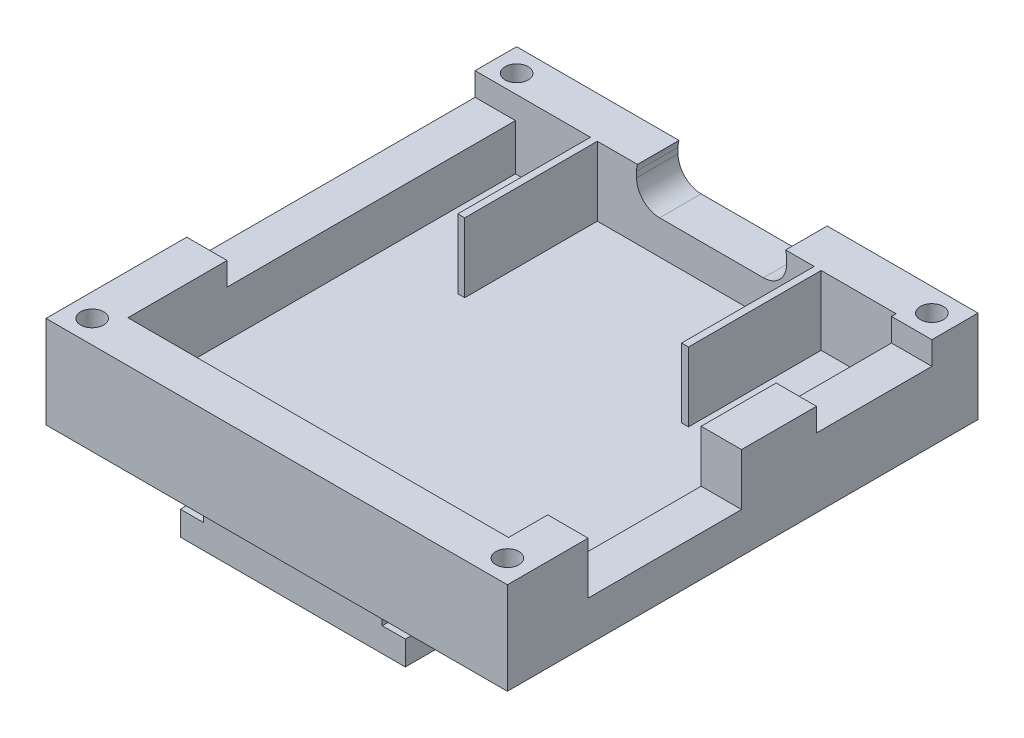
ISO-10303-21;
HEADER;
FILE_DESCRIPTION(('STEP AP214'),'2;1');
FILE_NAME('part.step','',(''),(''),'','','');
FILE_SCHEMA(('AUTOMOTIVE_DESIGN { 1 0 10303 214 1 1 1 1 }'));
ENDSEC;
DATA;
#1=APPLICATION_CONTEXT('core data for automotive mechanical design processes');
#2=APPLICATION_PROTOCOL_DEFINITION('international standard','automotive_design',2000,#1);
#3=PRODUCT_CONTEXT('',#1,'mechanical');
#4=PRODUCT('Part','Part','',(#3));
#5=PRODUCT_RELATED_PRODUCT_CATEGORY('part','',(#4));
#6=PRODUCT_DEFINITION_FORMATION('','',#4);
#7=PRODUCT_DEFINITION_CONTEXT('part definition',#1,'design');
#8=PRODUCT_DEFINITION('design','',#6,#7);
#9=PRODUCT_DEFINITION_SHAPE('','',#8);
#10=(LENGTH_UNIT() NAMED_UNIT(*) SI_UNIT(.MILLI.,.METRE.));
#11=(NAMED_UNIT(*) PLANE_ANGLE_UNIT() SI_UNIT($,.RADIAN.));
#12=(NAMED_UNIT(*) SI_UNIT($,.STERADIAN.) SOLID_ANGLE_UNIT());
#13=UNCERTAINTY_MEASURE_WITH_UNIT(LENGTH_MEASURE(1.E-05),#10,'distance_accuracy_value','');
#14=(GEOMETRIC_REPRESENTATION_CONTEXT(3) GLOBAL_UNCERTAINTY_ASSIGNED_CONTEXT((#13)) GLOBAL_UNIT_ASSIGNED_CONTEXT((#10,
#11,#12)) REPRESENTATION_CONTEXT('',''));
#15=CARTESIAN_POINT('',(0.,0.,0.));
#16=DIRECTION('',(0.,0.,1.));
#17=DIRECTION('',(1.,0.,0.));
#18=AXIS2_PLACEMENT_3D('',#15,#16,#17);
#19=CARTESIAN_POINT('',(-16.5,6.00000000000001,2.2));
#20=DIRECTION('',(0.,0.,-1.));
#21=DIRECTION('',(-1.,0.,0.));
#22=AXIS2_PLACEMENT_3D('',#19,#20,#21);
#23=PLANE('',#22);
#24=DIRECTION('',(0.,-1.,0.));
#25=VECTOR('',#24,1.);
#26=CARTESIAN_POINT('',(9.4,12.,2.19999999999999));
#27=LINE('',#26,#25);
#28=CARTESIAN_POINT('',(9.4,12.,2.2));
#29=VERTEX_POINT('',#28);
#30=CARTESIAN_POINT('',(9.4,6.00000000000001,2.2));
#31=VERTEX_POINT('',#30);
#32=EDGE_CURVE('E347',#29,#31,#27,.T.);
#33=ORIENTED_EDGE('',*,*,#32,.F.);
#34=DIRECTION('',(-1.,0.,0.));
#35=VECTOR('',#34,1.);
#36=CARTESIAN_POINT('',(-16.5,12.,2.2));
#37=LINE('',#36,#35);
#38=CARTESIAN_POINT('',(6.92288845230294,12.,2.2));
#39=VERTEX_POINT('',#38);
#40=EDGE_CURVE('E333',#29,#39,#37,.T.);
#41=ORIENTED_EDGE('',*,*,#40,.T.);
#42=CARTESIAN_POINT('',(5.,11.45,2.2));
#43=DIRECTION('',(0.,0.,-1.));
#44=DIRECTION('',(-1.,0.,0.));
#45=AXIS2_PLACEMENT_3D('',#42,#43,#44);
#46=CIRCLE('',#45,2.);
#47=CARTESIAN_POINT('',(7.,11.45,2.2));
#48=VERTEX_POINT('',#47);
#49=EDGE_CURVE('E11',#39,#48,#46,.T.);
#50=ORIENTED_EDGE('',*,*,#49,.T.);
#51=DIRECTION('',(0.,-1.,0.));
#52=VECTOR('',#51,1.);
#53=CARTESIAN_POINT('',(7.00000000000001,6.00000000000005,2.2));
#54=LINE('',#53,#52);
#55=CARTESIAN_POINT('',(7.,10.95,2.2));
#56=VERTEX_POINT('',#55);
#57=EDGE_CURVE('E54',#48,#56,#54,.T.);
#58=ORIENTED_EDGE('',*,*,#57,.T.);
#59=CARTESIAN_POINT('',(5.,10.95,2.2));
#60=DIRECTION('',(0.,0.,-1.));
#61=DIRECTION('',(-1.,0.,0.));
#62=AXIS2_PLACEMENT_3D('',#59,#60,#61);
#63=CIRCLE('',#62,2.);
#64=CARTESIAN_POINT('',(5.,8.95000000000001,2.2));
#65=VERTEX_POINT('',#64);
#66=EDGE_CURVE('E795',#56,#65,#63,.T.);
#67=ORIENTED_EDGE('',*,*,#66,.T.);
#68=DIRECTION('',(-1.,0.,0.));
#69=VECTOR('',#68,1.);
#70=CARTESIAN_POINT('',(-16.5,8.95000000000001,2.2));
#71=LINE('',#70,#69);
#72=CARTESIAN_POINT('',(-4.,8.95000000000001,2.2));
#73=VERTEX_POINT('',#72);
#74=EDGE_CURVE('E780',#65,#73,#71,.T.);
#75=ORIENTED_EDGE('',*,*,#74,.T.);
#76=CARTESIAN_POINT('',(-4.,10.95,2.2));
#77=DIRECTION('',(0.,0.,-1.));
#78=DIRECTION('',(-1.,0.,0.));
#79=AXIS2_PLACEMENT_3D('',#76,#77,#78);
#80=CIRCLE('',#79,2.);
#81=CARTESIAN_POINT('',(-6.,10.95,2.2));
#82=VERTEX_POINT('',#81);
#83=EDGE_CURVE('E784',#73,#82,#80,.T.);
#84=ORIENTED_EDGE('',*,*,#83,.T.);
#85=DIRECTION('',(0.,1.,0.));
#86=VECTOR('',#85,1.);
#87=CARTESIAN_POINT('',(-6.,6.00000000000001,2.2));
#88=LINE('',#87,#86);
#89=CARTESIAN_POINT('',(-6.,11.45,2.2));
#90=VERTEX_POINT('',#89);
#91=EDGE_CURVE('E788',#82,#90,#88,.T.);
#92=ORIENTED_EDGE('',*,*,#91,.T.);
#93=CARTESIAN_POINT('',(-4.,11.45,2.2));
#94=DIRECTION('',(0.,0.,-1.));
#95=DIRECTION('',(-1.,0.,0.));
#96=AXIS2_PLACEMENT_3D('',#93,#94,#95);
#97=CIRCLE('',#96,2.);
#98=CARTESIAN_POINT('',(-5.92288845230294,12.,2.2));
#99=VERTEX_POINT('',#98);
#100=EDGE_CURVE('E792',#90,#99,#97,.T.);
#101=ORIENTED_EDGE('',*,*,#100,.T.);
#102=CARTESIAN_POINT('',(-9.4,12.,2.2));
#103=VERTEX_POINT('',#102);
#104=EDGE_CURVE('E69',#99,#103,#37,.T.);
#105=ORIENTED_EDGE('',*,*,#104,.T.);
#106=DIRECTION('',(0.,-1.,0.));
#107=VECTOR('',#106,1.);
#108=CARTESIAN_POINT('',(-9.4,12.,2.19999999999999));
#109=LINE('',#108,#107);
#110=CARTESIAN_POINT('',(-9.4,6.00000000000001,2.19999999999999));
#111=VERTEX_POINT('',#110);
#112=EDGE_CURVE('E385',#103,#111,#109,.T.);
#113=ORIENTED_EDGE('',*,*,#112,.T.);
#114=DIRECTION('',(-1.,0.,0.));
#115=VECTOR('',#114,1.);
#116=CARTESIAN_POINT('',(-16.5,6.00000000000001,2.2));
#117=LINE('',#116,#115);
#118=EDGE_CURVE('E580',#31,#111,#117,.T.);
#119=ORIENTED_EDGE('',*,*,#118,.F.);
#120=EDGE_LOOP('',(#33,#41,#50,#58,#67,#75,#84,#92,#101,#105,#113,#119));
#121=FACE_BOUND('',#120,.T.);
#122=ADVANCED_FACE('F45',(#121),#23,.F.);
#123=DIRECTION('',(0.,-1.,0.));
#124=VECTOR('',#123,1.);
#125=CARTESIAN_POINT('',(10.,12.,2.19999999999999));
#126=LINE('',#125,#124);
#127=CARTESIAN_POINT('',(9.99999999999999,12.,2.2));
#128=VERTEX_POINT('',#127);
#129=CARTESIAN_POINT('',(10.,6.00000000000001,2.19999999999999));
#130=VERTEX_POINT('',#129);
#131=EDGE_CURVE('E357',#128,#130,#126,.T.);
#132=ORIENTED_EDGE('',*,*,#131,.T.);
#133=CARTESIAN_POINT('',(16.5,6.00000000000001,2.2));
#134=VERTEX_POINT('',#133);
#135=EDGE_CURVE('E576',#134,#130,#117,.T.);
#136=ORIENTED_EDGE('',*,*,#135,.F.);
#137=DIRECTION('',(0.,1.,0.));
#138=VECTOR('',#137,1.);
#139=CARTESIAN_POINT('',(16.5,6.00000000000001,2.2));
#140=LINE('',#139,#138);
#141=CARTESIAN_POINT('',(16.5,12.,2.19999999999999));
#142=VERTEX_POINT('',#141);
#143=EDGE_CURVE('E588',#134,#142,#140,.T.);
#144=ORIENTED_EDGE('',*,*,#143,.T.);
#145=EDGE_CURVE('E595',#142,#128,#37,.T.);
#146=ORIENTED_EDGE('',*,*,#145,.T.);
#147=EDGE_LOOP('',(#132,#136,#144,#146));
#148=FACE_BOUND('',#147,.T.);
#149=ADVANCED_FACE('F873',(#148),#23,.F.);
#150=DIRECTION('',(0.,-1.,0.));
#151=VECTOR('',#150,1.);
#152=CARTESIAN_POINT('',(-10.,12.,2.19999999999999));
#153=LINE('',#152,#151);
#154=CARTESIAN_POINT('',(-10.,12.,2.2));
#155=VERTEX_POINT('',#154);
#156=CARTESIAN_POINT('',(-10.,6.00000000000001,2.2));
#157=VERTEX_POINT('',#156);
#158=EDGE_CURVE('E61',#155,#157,#153,.T.);
#159=ORIENTED_EDGE('',*,*,#158,.F.);
#160=CARTESIAN_POINT('',(-20.,12.,2.2));
#161=VERTEX_POINT('',#160);
#162=EDGE_CURVE('E593',#155,#161,#37,.T.);
#163=ORIENTED_EDGE('',*,*,#162,.T.);
#164=DIRECTION('',(0.,-1.,0.));
#165=VECTOR('',#164,1.);
#166=CARTESIAN_POINT('',(-20.,10.,2.2));
#167=LINE('',#166,#165);
#168=CARTESIAN_POINT('',(-20.,10.,2.2));
#169=VERTEX_POINT('',#168);
#170=EDGE_CURVE('E547',#161,#169,#167,.T.);
#171=ORIENTED_EDGE('',*,*,#170,.T.);
#172=DIRECTION('',(-1.,0.,0.));
#173=VECTOR('',#172,1.);
#174=CARTESIAN_POINT('',(-7.99999999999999,10.,2.2));
#175=LINE('',#174,#173);
#176=CARTESIAN_POINT('',(-16.5,10.,2.2));
#177=VERTEX_POINT('',#176);
#178=EDGE_CURVE('E554',#177,#169,#175,.T.);
#179=ORIENTED_EDGE('',*,*,#178,.F.);
#180=DIRECTION('',(0.,1.,0.));
#181=VECTOR('',#180,1.);
#182=CARTESIAN_POINT('',(-16.5,6.00000000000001,2.2));
#183=LINE('',#182,#181);
#184=CARTESIAN_POINT('',(-16.5,6.00000000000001,2.2));
#185=VERTEX_POINT('',#184);
#186=EDGE_CURVE('E612',#185,#177,#183,.T.);
#187=ORIENTED_EDGE('',*,*,#186,.F.);
#188=EDGE_CURVE('E574',#157,#185,#117,.T.);
#189=ORIENTED_EDGE('',*,*,#188,.F.);
#190=EDGE_LOOP('',(#159,#163,#171,#179,#187,#189));
#191=FACE_BOUND('',#190,.T.);
#192=ADVANCED_FACE('F839',(#191),#23,.F.);
#193=CARTESIAN_POINT('',(0.,6.00000000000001,0.));
#194=DIRECTION('',(0.,-1.,0.));
#195=DIRECTION('',(0.,0.,-1.));
#196=AXIS2_PLACEMENT_3D('',#193,#194,#195);
#197=PLANE('',#196);
#198=DIRECTION('',(0.,0.,1.));
#199=VECTOR('',#198,1.);
#200=CARTESIAN_POINT('',(9.4,6.00000000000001,13.7));
#201=LINE('',#200,#199);
#202=CARTESIAN_POINT('',(9.4,6.00000000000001,13.7));
#203=VERTEX_POINT('',#202);
#204=EDGE_CURVE('E343',#31,#203,#201,.T.);
#205=ORIENTED_EDGE('',*,*,#204,.F.);
#206=ORIENTED_EDGE('',*,*,#118,.T.);
#207=DIRECTION('',(0.,0.,-1.));
#208=VECTOR('',#207,1.);
#209=CARTESIAN_POINT('',(-9.4,6.00000000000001,13.7));
#210=LINE('',#209,#208);
#211=CARTESIAN_POINT('',(-9.4,6.00000000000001,13.7));
#212=VERTEX_POINT('',#211);
#213=EDGE_CURVE('E391',#212,#111,#210,.T.);
#214=ORIENTED_EDGE('',*,*,#213,.F.);
#215=DIRECTION('',(1.,0.,0.));
#216=VECTOR('',#215,1.);
#217=CARTESIAN_POINT('',(-10.,6.00000000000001,13.7));
#218=LINE('',#217,#216);
#219=CARTESIAN_POINT('',(-10.,6.00000000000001,13.7));
#220=VERTEX_POINT('',#219);
#221=EDGE_CURVE('E395',#220,#212,#218,.T.);
#222=ORIENTED_EDGE('',*,*,#221,.F.);
#223=DIRECTION('',(0.,0.,1.));
#224=VECTOR('',#223,1.);
#225=CARTESIAN_POINT('',(-10.,6.00000000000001,13.7));
#226=LINE('',#225,#224);
#227=EDGE_CURVE('E363',#157,#220,#226,.T.);
#228=ORIENTED_EDGE('',*,*,#227,.F.);
#229=ORIENTED_EDGE('',*,*,#188,.T.);
#230=DIRECTION('',(0.,0.,1.));
#231=VECTOR('',#230,1.);
#232=CARTESIAN_POINT('',(-16.5,6.00000000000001,35.8));
#233=LINE('',#232,#231);
#234=CARTESIAN_POINT('',(-16.5,6.00000000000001,35.8));
#235=VERTEX_POINT('',#234);
#236=EDGE_CURVE('E579',#185,#235,#233,.T.);
#237=ORIENTED_EDGE('',*,*,#236,.T.);
#238=DIRECTION('',(1.,0.,0.));
#239=VECTOR('',#238,1.);
#240=CARTESIAN_POINT('',(-16.5,6.00000000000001,35.8));
#241=LINE('',#240,#239);
#242=CARTESIAN_POINT('',(16.5,6.00000000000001,35.8));
#243=VERTEX_POINT('',#242);
#244=EDGE_CURVE('E584',#235,#243,#241,.T.);
#245=ORIENTED_EDGE('',*,*,#244,.T.);
#246=DIRECTION('',(0.,0.,-1.));
#247=VECTOR('',#246,1.);
#248=CARTESIAN_POINT('',(16.5,6.00000000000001,35.8));
#249=LINE('',#248,#247);
#250=EDGE_CURVE('E570',#243,#134,#249,.T.);
#251=ORIENTED_EDGE('',*,*,#250,.T.);
#252=ORIENTED_EDGE('',*,*,#135,.T.);
#253=DIRECTION('',(0.,0.,-1.));
#254=VECTOR('',#253,1.);
#255=CARTESIAN_POINT('',(10.,6.00000000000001,13.7));
#256=LINE('',#255,#254);
#257=CARTESIAN_POINT('',(10.,6.00000000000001,13.7));
#258=VERTEX_POINT('',#257);
#259=EDGE_CURVE('E337',#258,#130,#256,.T.);
#260=ORIENTED_EDGE('',*,*,#259,.F.);
#261=DIRECTION('',(1.,0.,0.));
#262=VECTOR('',#261,1.);
#263=CARTESIAN_POINT('',(9.4,6.00000000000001,13.7));
#264=LINE('',#263,#262);
#265=EDGE_CURVE('E362',#203,#258,#264,.T.);
#266=ORIENTED_EDGE('',*,*,#265,.F.);
#267=EDGE_LOOP('',(#205,#206,#214,#222,#228,#229,#237,#245,#251,#252,#260,#266));
#268=FACE_BOUND('',#267,.T.);
#269=ADVANCED_FACE('F854',(#268),#197,.F.);
#270=CARTESIAN_POINT('',(-20.,12.,38.));
#271=DIRECTION('',(0.,-1.,0.));
#272=DIRECTION('',(1.,0.,0.));
#273=AXIS2_PLACEMENT_3D('',#270,#271,#272);
#274=PLANE('',#273);
#275=CARTESIAN_POINT('',(18.,12.,0.599999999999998));
#276=DIRECTION('',(0.,1.,0.));
#277=DIRECTION('',(0.,0.,1.));
#278=AXIS2_PLACEMENT_3D('',#275,#276,#277);
#279=CIRCLE('',#278,1.);
#280=CARTESIAN_POINT('',(18.,12.,1.6));
#281=VERTEX_POINT('',#280);
#282=EDGE_CURVE('E411',#281,#281,#279,.T.);
#283=ORIENTED_EDGE('',*,*,#282,.F.);
#284=EDGE_LOOP('',(#283));
#285=FACE_BOUND('',#284,.T.);
#286=DIRECTION('',(1.,0.,0.));
#287=VECTOR('',#286,1.);
#288=CARTESIAN_POINT('',(20.,12.,-1.4));
#289=LINE('',#288,#287);
#290=CARTESIAN_POINT('',(6.92288845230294,12.,-1.4));
#291=VERTEX_POINT('',#290);
#292=CARTESIAN_POINT('',(20.,12.,-1.4));
#293=VERTEX_POINT('',#292);
#294=EDGE_CURVE('E622',#291,#293,#289,.T.);
#295=ORIENTED_EDGE('',*,*,#294,.F.);
#296=DIRECTION('',(0.,0.,-1.));
#297=VECTOR('',#296,1.);
#298=CARTESIAN_POINT('',(6.92288845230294,12.,5.6));
#299=LINE('',#298,#297);
#300=EDGE_CURVE('E491',#291,#39,#299,.F.);
#301=ORIENTED_EDGE('',*,*,#300,.T.);
#302=ORIENTED_EDGE('',*,*,#40,.F.);
#303=DIRECTION('',(0.,0.,1.));
#304=VECTOR('',#303,1.);
#305=CARTESIAN_POINT('',(9.4,12.,13.7));
#306=LINE('',#305,#304);
#307=CARTESIAN_POINT('',(9.4,12.,13.7));
#308=VERTEX_POINT('',#307);
#309=EDGE_CURVE('E324',#29,#308,#306,.T.);
#310=ORIENTED_EDGE('',*,*,#309,.T.);
#311=DIRECTION('',(1.,0.,0.));
#312=VECTOR('',#311,1.);
#313=CARTESIAN_POINT('',(9.4,12.,13.7));
#314=LINE('',#313,#312);
#315=CARTESIAN_POINT('',(10.,12.,13.7));
#316=VERTEX_POINT('',#315);
#317=EDGE_CURVE('E330',#308,#316,#314,.T.);
#318=ORIENTED_EDGE('',*,*,#317,.T.);
#319=DIRECTION('',(0.,0.,-1.));
#320=VECTOR('',#319,1.);
#321=CARTESIAN_POINT('',(10.,12.,13.7));
#322=LINE('',#321,#320);
#323=EDGE_CURVE('E354',#316,#128,#322,.T.);
#324=ORIENTED_EDGE('',*,*,#323,.T.);
#325=ORIENTED_EDGE('',*,*,#145,.F.);
#326=DIRECTION('',(0.,0.,-1.));
#327=VECTOR('',#326,1.);
#328=CARTESIAN_POINT('',(16.5,12.,35.8));
#329=LINE('',#328,#327);
#330=CARTESIAN_POINT('',(16.5,12.,2.6));
#331=VERTEX_POINT('',#330);
#332=EDGE_CURVE('E569',#331,#142,#329,.T.);
#333=ORIENTED_EDGE('',*,*,#332,.F.);
#334=DIRECTION('',(1.,0.,0.));
#335=VECTOR('',#334,1.);
#336=CARTESIAN_POINT('',(-20.,12.,2.6));
#337=LINE('',#336,#335);
#338=CARTESIAN_POINT('',(20.,12.,2.6));
#339=VERTEX_POINT('',#338);
#340=EDGE_CURVE('E540',#331,#339,#337,.T.);
#341=ORIENTED_EDGE('',*,*,#340,.T.);
#342=DIRECTION('',(0.,0.,-1.));
#343=VECTOR('',#342,1.);
#344=CARTESIAN_POINT('',(20.,12.,38.));
#345=LINE('',#344,#343);
#346=EDGE_CURVE('E733',#339,#293,#345,.T.);
#347=ORIENTED_EDGE('',*,*,#346,.T.);
#348=EDGE_LOOP('',(#295,#301,#302,#310,#318,#324,#325,#333,#341,#347));
#349=FACE_BOUND('',#348,.T.);
#350=ADVANCED_FACE('F327',(#285,#349),#274,.F.);
#351=CARTESIAN_POINT('',(-18.,12.,0.599999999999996));
#352=DIRECTION('',(0.,1.,0.));
#353=DIRECTION('',(0.,0.,1.));
#354=AXIS2_PLACEMENT_3D('',#351,#352,#353);
#355=CIRCLE('',#354,1.);
#356=CARTESIAN_POINT('',(-18.,12.,1.6));
#357=VERTEX_POINT('',#356);
#358=EDGE_CURVE('E428',#357,#357,#355,.T.);
#359=ORIENTED_EDGE('',*,*,#358,.F.);
#360=EDGE_LOOP('',(#359));
#361=FACE_BOUND('',#360,.T.);
#362=ORIENTED_EDGE('',*,*,#104,.F.);
#363=DIRECTION('',(0.,0.,-1.));
#364=VECTOR('',#363,1.);
#365=CARTESIAN_POINT('',(-5.92288845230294,12.,5.6));
#366=LINE('',#365,#364);
#367=CARTESIAN_POINT('',(-5.92288845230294,12.,-1.4));
#368=VERTEX_POINT('',#367);
#369=EDGE_CURVE('E473',#99,#368,#366,.T.);
#370=ORIENTED_EDGE('',*,*,#369,.T.);
#371=CARTESIAN_POINT('',(-20.,12.,-1.4));
#372=VERTEX_POINT('',#371);
#373=EDGE_CURVE('E623',#372,#368,#289,.T.);
#374=ORIENTED_EDGE('',*,*,#373,.F.);
#375=DIRECTION('',(0.,0.,-1.));
#376=VECTOR('',#375,1.);
#377=CARTESIAN_POINT('',(-20.,12.,38.));
#378=LINE('',#377,#376);
#379=EDGE_CURVE('E728',#161,#372,#378,.T.);
#380=ORIENTED_EDGE('',*,*,#379,.F.);
#381=ORIENTED_EDGE('',*,*,#162,.F.);
#382=DIRECTION('',(0.,0.,1.));
#383=VECTOR('',#382,1.);
#384=CARTESIAN_POINT('',(-10.,12.,13.7));
#385=LINE('',#384,#383);
#386=CARTESIAN_POINT('',(-10.,12.,13.7));
#387=VERTEX_POINT('',#386);
#388=EDGE_CURVE('E396',#155,#387,#385,.T.);
#389=ORIENTED_EDGE('',*,*,#388,.T.);
#390=DIRECTION('',(1.,0.,0.));
#391=VECTOR('',#390,1.);
#392=CARTESIAN_POINT('',(-10.,12.,13.7));
#393=LINE('',#392,#391);
#394=CARTESIAN_POINT('',(-9.4,12.,13.7));
#395=VERTEX_POINT('',#394);
#396=EDGE_CURVE('E405',#387,#395,#393,.T.);
#397=ORIENTED_EDGE('',*,*,#396,.T.);
#398=DIRECTION('',(0.,0.,-1.));
#399=VECTOR('',#398,1.);
#400=CARTESIAN_POINT('',(-9.4,12.,13.7));
#401=LINE('',#400,#399);
#402=EDGE_CURVE('E390',#395,#103,#401,.T.);
#403=ORIENTED_EDGE('',*,*,#402,.T.);
#404=EDGE_LOOP('',(#362,#370,#374,#380,#381,#389,#397,#403));
#405=FACE_BOUND('',#404,.T.);
#406=ADVANCED_FACE('F831',(#361,#405),#274,.F.);
#407=CARTESIAN_POINT('',(20.,12.,19.1));
#408=VERTEX_POINT('',#407);
#409=CARTESIAN_POINT('',(20.,12.,12.6));
#410=VERTEX_POINT('',#409);
#411=EDGE_CURVE('E739',#408,#410,#345,.T.);
#412=ORIENTED_EDGE('',*,*,#411,.T.);
#413=DIRECTION('',(-1.,0.,0.));
#414=VECTOR('',#413,1.);
#415=CARTESIAN_POINT('',(-20.,12.,12.6));
#416=LINE('',#415,#414);
#417=CARTESIAN_POINT('',(16.5,12.,12.6));
#418=VERTEX_POINT('',#417);
#419=EDGE_CURVE('E536',#410,#418,#416,.T.);
#420=ORIENTED_EDGE('',*,*,#419,.T.);
#421=CARTESIAN_POINT('',(16.5,12.,19.1));
#422=VERTEX_POINT('',#421);
#423=EDGE_CURVE('E594',#422,#418,#329,.T.);
#424=ORIENTED_EDGE('',*,*,#423,.F.);
#425=DIRECTION('',(1.,0.,0.));
#426=VECTOR('',#425,1.);
#427=CARTESIAN_POINT('',(-20.,12.,19.1));
#428=LINE('',#427,#426);
#429=EDGE_CURVE('E532',#422,#408,#428,.T.);
#430=ORIENTED_EDGE('',*,*,#429,.T.);
#431=EDGE_LOOP('',(#412,#420,#424,#430));
#432=FACE_BOUND('',#431,.T.);
#433=ADVANCED_FACE('F886',(#432),#274,.F.);
#434=CARTESIAN_POINT('',(0.,0.,0.));
#435=DIRECTION('',(0.,0.,1.));
#436=DIRECTION('',(1.,0.,0.));
#437=AXIS2_PLACEMENT_3D('',#434,#435,#436);
#438=PLANE('',#437);
#439=DIRECTION('',(-1.,0.,0.));
#440=VECTOR('',#439,1.);
#441=CARTESIAN_POINT('',(20.,4.00000000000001,0.));
#442=LINE('',#441,#440);
#443=CARTESIAN_POINT('',(7.75,4.00000000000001,0.));
#444=VERTEX_POINT('',#443);
#445=CARTESIAN_POINT('',(-7.75,4.00000000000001,0.));
#446=VERTEX_POINT('',#445);
#447=EDGE_CURVE('E636',#444,#446,#442,.T.);
#448=ORIENTED_EDGE('',*,*,#447,.F.);
#449=DIRECTION('',(0.,1.,0.));
#450=VECTOR('',#449,1.);
#451=CARTESIAN_POINT('',(7.75,4.00000000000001,0.));
#452=LINE('',#451,#450);
#453=CARTESIAN_POINT('',(7.75,2.10000000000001,0.));
#454=VERTEX_POINT('',#453);
#455=EDGE_CURVE('E691',#454,#444,#452,.T.);
#456=ORIENTED_EDGE('',*,*,#455,.F.);
#457=DIRECTION('',(-1.,0.,0.));
#458=VECTOR('',#457,1.);
#459=CARTESIAN_POINT('',(7.75,2.10000000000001,0.));
#460=LINE('',#459,#458);
#461=CARTESIAN_POINT('',(9.75,2.1,0.));
#462=VERTEX_POINT('',#461);
#463=EDGE_CURVE('E688',#462,#454,#460,.T.);
#464=ORIENTED_EDGE('',*,*,#463,.F.);
#465=DIRECTION('',(0.,1.,0.));
#466=VECTOR('',#465,1.);
#467=CARTESIAN_POINT('',(9.75,2.1,0.));
#468=LINE('',#467,#466);
#469=CARTESIAN_POINT('',(9.75,0.,0.));
#470=VERTEX_POINT('',#469);
#471=EDGE_CURVE('E656',#470,#462,#468,.T.);
#472=ORIENTED_EDGE('',*,*,#471,.F.);
#473=DIRECTION('',(1.,0.,0.));
#474=VECTOR('',#473,1.);
#475=CARTESIAN_POINT('',(-9.75,0.,0.));
#476=LINE('',#475,#474);
#477=CARTESIAN_POINT('',(-9.75,0.,0.));
#478=VERTEX_POINT('',#477);
#479=EDGE_CURVE('E666',#478,#470,#476,.T.);
#480=ORIENTED_EDGE('',*,*,#479,.F.);
#481=DIRECTION('',(0.,-1.,0.));
#482=VECTOR('',#481,1.);
#483=CARTESIAN_POINT('',(-9.75,2.1,0.));
#484=LINE('',#483,#482);
#485=CARTESIAN_POINT('',(-9.75,2.1,0.));
#486=VERTEX_POINT('',#485);
#487=EDGE_CURVE('E701',#486,#478,#484,.T.);
#488=ORIENTED_EDGE('',*,*,#487,.F.);
#489=DIRECTION('',(-1.,0.,0.));
#490=VECTOR('',#489,1.);
#491=CARTESIAN_POINT('',(-9.75,2.1,0.));
#492=LINE('',#491,#490);
#493=CARTESIAN_POINT('',(-7.75,2.10000000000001,0.));
#494=VERTEX_POINT('',#493);
#495=EDGE_CURVE('E698',#494,#486,#492,.T.);
#496=ORIENTED_EDGE('',*,*,#495,.F.);
#497=DIRECTION('',(0.,-1.,0.));
#498=VECTOR('',#497,1.);
#499=CARTESIAN_POINT('',(-7.75,4.00000000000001,0.));
#500=LINE('',#499,#498);
#501=EDGE_CURVE('E695',#446,#494,#500,.T.);
#502=ORIENTED_EDGE('',*,*,#501,.F.);
#503=EDGE_LOOP('',(#448,#456,#464,#472,#480,#488,#496,#502));
#504=FACE_BOUND('',#503,.T.);
#505=ADVANCED_FACE('F1265',(#504),#438,.F.);
#506=CARTESIAN_POINT('',(9.75,2.1,38.));
#507=DIRECTION('',(-1.,0.,0.));
#508=DIRECTION('',(0.,0.,1.));
#509=AXIS2_PLACEMENT_3D('',#506,#507,#508);
#510=PLANE('',#509);
#511=ORIENTED_EDGE('',*,*,#471,.T.);
#512=DIRECTION('',(0.,0.,-1.));
#513=VECTOR('',#512,1.);
#514=CARTESIAN_POINT('',(9.75,2.1,38.));
#515=LINE('',#514,#513);
#516=CARTESIAN_POINT('',(9.75,2.1,38.));
#517=VERTEX_POINT('',#516);
#518=EDGE_CURVE('E660',#517,#462,#515,.T.);
#519=ORIENTED_EDGE('',*,*,#518,.F.);
#520=DIRECTION('',(0.,1.,0.));
#521=VECTOR('',#520,1.);
#522=CARTESIAN_POINT('',(9.75,2.1,38.));
#523=LINE('',#522,#521);
#524=CARTESIAN_POINT('',(9.75,0.,38.));
#525=VERTEX_POINT('',#524);
#526=EDGE_CURVE('E661',#525,#517,#523,.T.);
#527=ORIENTED_EDGE('',*,*,#526,.F.);
#528=DIRECTION('',(0.,0.,-1.));
#529=VECTOR('',#528,1.);
#530=CARTESIAN_POINT('',(9.75,0.,38.));
#531=LINE('',#530,#529);
#532=EDGE_CURVE('E684',#525,#470,#531,.T.);
#533=ORIENTED_EDGE('',*,*,#532,.T.);
#534=EDGE_LOOP('',(#511,#519,#527,#533));
#535=FACE_BOUND('',#534,.T.);
#536=ADVANCED_FACE('F47',(#535),#510,.F.);
#537=CARTESIAN_POINT('',(7.75,2.10000000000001,38.));
#538=DIRECTION('',(0.,-1.,0.));
#539=DIRECTION('',(1.,0.,0.));
#540=AXIS2_PLACEMENT_3D('',#537,#538,#539);
#541=PLANE('',#540);
#542=ORIENTED_EDGE('',*,*,#463,.T.);
#543=DIRECTION('',(0.,0.,-1.));
#544=VECTOR('',#543,1.);
#545=CARTESIAN_POINT('',(7.75,2.10000000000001,38.));
#546=LINE('',#545,#544);
#547=CARTESIAN_POINT('',(7.75,2.10000000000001,38.));
#548=VERTEX_POINT('',#547);
#549=EDGE_CURVE('E746',#548,#454,#546,.T.);
#550=ORIENTED_EDGE('',*,*,#549,.F.);
#551=DIRECTION('',(-1.,0.,0.));
#552=VECTOR('',#551,1.);
#553=CARTESIAN_POINT('',(7.75,2.10000000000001,38.));
#554=LINE('',#553,#552);
#555=EDGE_CURVE('E665',#517,#548,#554,.T.);
#556=ORIENTED_EDGE('',*,*,#555,.F.);
#557=ORIENTED_EDGE('',*,*,#518,.T.);
#558=EDGE_LOOP('',(#542,#550,#556,#557));
#559=FACE_BOUND('',#558,.T.);
#560=ADVANCED_FACE('F1399',(#559),#541,.F.);
#561=CARTESIAN_POINT('',(7.75,4.00000000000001,38.));
#562=DIRECTION('',(-1.,0.,0.));
#563=DIRECTION('',(0.,0.,1.));
#564=AXIS2_PLACEMENT_3D('',#561,#562,#563);
#565=PLANE('',#564);
#566=ORIENTED_EDGE('',*,*,#455,.T.);
#567=DIRECTION('',(0.,0.,-1.));
#568=VECTOR('',#567,1.);
#569=CARTESIAN_POINT('',(7.75,4.00000000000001,38.));
#570=LINE('',#569,#568);
#571=CARTESIAN_POINT('',(7.75,4.00000000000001,38.));
#572=VERTEX_POINT('',#571);
#573=EDGE_CURVE('E742',#572,#444,#570,.T.);
#574=ORIENTED_EDGE('',*,*,#573,.F.);
#575=DIRECTION('',(0.,1.,0.));
#576=VECTOR('',#575,1.);
#577=CARTESIAN_POINT('',(7.75,4.00000000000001,38.));
#578=LINE('',#577,#576);
#579=EDGE_CURVE('E669',#548,#572,#578,.T.);
#580=ORIENTED_EDGE('',*,*,#579,.F.);
#581=ORIENTED_EDGE('',*,*,#549,.T.);
#582=EDGE_LOOP('',(#566,#574,#580,#581));
#583=FACE_BOUND('',#582,.T.);
#584=ADVANCED_FACE('F1391',(#583),#565,.F.);
#585=CARTESIAN_POINT('',(20.,12.,38.));
#586=DIRECTION('',(-1.,0.,0.));
#587=DIRECTION('',(0.,0.,1.));
#588=AXIS2_PLACEMENT_3D('',#585,#586,#587);
#589=PLANE('',#588);
#590=ORIENTED_EDGE('',*,*,#346,.F.);
#591=DIRECTION('',(0.,1.,0.));
#592=VECTOR('',#591,1.);
#593=CARTESIAN_POINT('',(20.,14.,2.6));
#594=LINE('',#593,#592);
#595=CARTESIAN_POINT('',(20.,10.,2.6));
#596=VERTEX_POINT('',#595);
#597=EDGE_CURVE('E495',#596,#339,#594,.T.);
#598=ORIENTED_EDGE('',*,*,#597,.F.);
#599=DIRECTION('',(0.,0.,-1.));
#600=VECTOR('',#599,1.);
#601=CARTESIAN_POINT('',(20.,10.,12.6));
#602=LINE('',#601,#600);
#603=CARTESIAN_POINT('',(20.,10.,12.6));
#604=VERTEX_POINT('',#603);
#605=EDGE_CURVE('E503',#604,#596,#602,.T.);
#606=ORIENTED_EDGE('',*,*,#605,.F.);
#607=DIRECTION('',(0.,-1.,0.));
#608=VECTOR('',#607,1.);
#609=CARTESIAN_POINT('',(20.,14.,12.6));
#610=LINE('',#609,#608);
#611=EDGE_CURVE('E498',#410,#604,#610,.T.);
#612=ORIENTED_EDGE('',*,*,#611,.F.);
#613=ORIENTED_EDGE('',*,*,#411,.F.);
#614=DIRECTION('',(0.,1.,0.));
#615=VECTOR('',#614,1.);
#616=CARTESIAN_POINT('',(20.,7.50000000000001,19.1));
#617=LINE('',#616,#615);
#618=CARTESIAN_POINT('',(20.,7.50000000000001,19.1));
#619=VERTEX_POINT('',#618);
#620=EDGE_CURVE('E499',#619,#408,#617,.T.);
#621=ORIENTED_EDGE('',*,*,#620,.F.);
#622=DIRECTION('',(0.,0.,-1.));
#623=VECTOR('',#622,1.);
#624=CARTESIAN_POINT('',(20.,7.50000000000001,32.4));
#625=LINE('',#624,#623);
#626=CARTESIAN_POINT('',(20.,7.50000000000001,32.4));
#627=VERTEX_POINT('',#626);
#628=EDGE_CURVE('E517',#627,#619,#625,.T.);
#629=ORIENTED_EDGE('',*,*,#628,.F.);
#630=DIRECTION('',(0.,-1.,0.));
#631=VECTOR('',#630,1.);
#632=CARTESIAN_POINT('',(20.,7.50000000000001,32.4));
#633=LINE('',#632,#631);
#634=CARTESIAN_POINT('',(20.,12.,32.4));
#635=VERTEX_POINT('',#634);
#636=EDGE_CURVE('E523',#635,#627,#633,.T.);
#637=ORIENTED_EDGE('',*,*,#636,.F.);
#638=CARTESIAN_POINT('',(20.,12.,39.4));
#639=VERTEX_POINT('',#638);
#640=EDGE_CURVE('E734',#639,#635,#345,.T.);
#641=ORIENTED_EDGE('',*,*,#640,.F.);
#642=DIRECTION('',(0.,1.,0.));
#643=VECTOR('',#642,1.);
#644=CARTESIAN_POINT('',(20.,4.00000000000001,39.4));
#645=LINE('',#644,#643);
#646=CARTESIAN_POINT('',(20.,4.00000000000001,39.4));
#647=VERTEX_POINT('',#646);
#648=EDGE_CURVE('E635',#647,#639,#645,.T.);
#649=ORIENTED_EDGE('',*,*,#648,.F.);
#650=DIRECTION('',(0.,0.,-1.));
#651=VECTOR('',#650,1.);
#652=CARTESIAN_POINT('',(20.,4.00000000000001,38.));
#653=LINE('',#652,#651);
#654=CARTESIAN_POINT('',(20.,4.00000000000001,-1.4));
#655=VERTEX_POINT('',#654);
#656=EDGE_CURVE('E738',#647,#655,#653,.T.);
#657=ORIENTED_EDGE('',*,*,#656,.T.);
#658=DIRECTION('',(0.,-1.,0.));
#659=VECTOR('',#658,1.);
#660=CARTESIAN_POINT('',(20.,4.00000000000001,-1.4));
#661=LINE('',#660,#659);
#662=EDGE_CURVE('E627',#293,#655,#661,.T.);
#663=ORIENTED_EDGE('',*,*,#662,.F.);
#664=EDGE_LOOP('',(#590,#598,#606,#612,#613,#621,#629,#637,#641,#649,#657,#663));
#665=FACE_BOUND('',#664,.T.);
#666=ADVANCED_FACE('F893',(#665),#589,.F.);
#667=CARTESIAN_POINT('',(18.,12.,37.4));
#668=DIRECTION('',(0.,1.,0.));
#669=DIRECTION('',(0.,0.,1.));
#670=AXIS2_PLACEMENT_3D('',#667,#668,#669);
#671=CIRCLE('',#670,1.);
#672=CARTESIAN_POINT('',(18.,12.,38.4));
#673=VERTEX_POINT('',#672);
#674=EDGE_CURVE('E419',#673,#673,#671,.T.);
#675=ORIENTED_EDGE('',*,*,#674,.F.);
#676=EDGE_LOOP('',(#675));
#677=FACE_BOUND('',#676,.T.);
#678=CARTESIAN_POINT('',(-18.,12.,37.4));
#679=DIRECTION('',(0.,1.,0.));
#680=DIRECTION('',(0.,0.,1.));
#681=AXIS2_PLACEMENT_3D('',#678,#679,#680);
#682=CIRCLE('',#681,1.);
#683=CARTESIAN_POINT('',(-18.,12.,38.4));
#684=VERTEX_POINT('',#683);
#685=EDGE_CURVE('E423',#684,#684,#682,.T.);
#686=ORIENTED_EDGE('',*,*,#685,.F.);
#687=EDGE_LOOP('',(#686));
#688=FACE_BOUND('',#687,.T.);
#689=ORIENTED_EDGE('',*,*,#640,.T.);
#690=DIRECTION('',(-1.,0.,0.));
#691=VECTOR('',#690,1.);
#692=CARTESIAN_POINT('',(-20.,12.,32.4));
#693=LINE('',#692,#691);
#694=CARTESIAN_POINT('',(16.5,12.,32.4));
#695=VERTEX_POINT('',#694);
#696=EDGE_CURVE('E511',#635,#695,#693,.T.);
#697=ORIENTED_EDGE('',*,*,#696,.T.);
#698=CARTESIAN_POINT('',(16.5,12.,35.8));
#699=VERTEX_POINT('',#698);
#700=EDGE_CURVE('E589',#699,#695,#329,.T.);
#701=ORIENTED_EDGE('',*,*,#700,.F.);
#702=DIRECTION('',(1.,0.,0.));
#703=VECTOR('',#702,1.);
#704=CARTESIAN_POINT('',(-16.5,12.,35.8));
#705=LINE('',#704,#703);
#706=CARTESIAN_POINT('',(-16.5,12.,35.8));
#707=VERTEX_POINT('',#706);
#708=EDGE_CURVE('E575',#707,#699,#705,.T.);
#709=ORIENTED_EDGE('',*,*,#708,.F.);
#710=DIRECTION('',(0.,0.,1.));
#711=VECTOR('',#710,1.);
#712=CARTESIAN_POINT('',(-16.5,12.,35.8));
#713=LINE('',#712,#711);
#714=CARTESIAN_POINT('',(-16.5,12.,27.2));
#715=VERTEX_POINT('',#714);
#716=EDGE_CURVE('E598',#715,#707,#713,.T.);
#717=ORIENTED_EDGE('',*,*,#716,.F.);
#718=DIRECTION('',(-1.,0.,0.));
#719=VECTOR('',#718,1.);
#720=CARTESIAN_POINT('',(-20.,12.,27.2));
#721=LINE('',#720,#719);
#722=CARTESIAN_POINT('',(-20.,12.,27.2));
#723=VERTEX_POINT('',#722);
#724=EDGE_CURVE('E565',#715,#723,#721,.T.);
#725=ORIENTED_EDGE('',*,*,#724,.T.);
#726=CARTESIAN_POINT('',(-20.,12.,39.4));
#727=VERTEX_POINT('',#726);
#728=EDGE_CURVE('E729',#727,#723,#378,.T.);
#729=ORIENTED_EDGE('',*,*,#728,.F.);
#730=DIRECTION('',(-1.,0.,0.));
#731=VECTOR('',#730,1.);
#732=CARTESIAN_POINT('',(-20.,12.,39.4));
#733=LINE('',#732,#731);
#734=EDGE_CURVE('E644',#639,#727,#733,.T.);
#735=ORIENTED_EDGE('',*,*,#734,.F.);
#736=EDGE_LOOP('',(#689,#697,#701,#709,#717,#725,#729,#735));
#737=FACE_BOUND('',#736,.T.);
#738=ADVANCED_FACE('F866',(#677,#688,#737),#274,.F.);
#739=CARTESIAN_POINT('',(-20.,12.,38.));
#740=DIRECTION('',(1.,0.,0.));
#741=DIRECTION('',(0.,0.,-1.));
#742=AXIS2_PLACEMENT_3D('',#739,#740,#741);
#743=PLANE('',#742);
#744=ORIENTED_EDGE('',*,*,#728,.T.);
#745=DIRECTION('',(0.,1.,0.));
#746=VECTOR('',#745,1.);
#747=CARTESIAN_POINT('',(-20.,10.,27.2));
#748=LINE('',#747,#746);
#749=CARTESIAN_POINT('',(-20.,10.,27.2));
#750=VERTEX_POINT('',#749);
#751=EDGE_CURVE('E544',#750,#723,#748,.T.);
#752=ORIENTED_EDGE('',*,*,#751,.F.);
#753=DIRECTION('',(0.,0.,1.));
#754=VECTOR('',#753,1.);
#755=CARTESIAN_POINT('',(-20.,10.,2.2));
#756=LINE('',#755,#754);
#757=EDGE_CURVE('E550',#169,#750,#756,.T.);
#758=ORIENTED_EDGE('',*,*,#757,.F.);
#759=ORIENTED_EDGE('',*,*,#170,.F.);
#760=ORIENTED_EDGE('',*,*,#379,.T.);
#761=DIRECTION('',(0.,1.,0.));
#762=VECTOR('',#761,1.);
#763=CARTESIAN_POINT('',(-20.,4.,-1.4));
#764=LINE('',#763,#762);
#765=CARTESIAN_POINT('',(-20.,4.,-1.4));
#766=VERTEX_POINT('',#765);
#767=EDGE_CURVE('E607',#766,#372,#764,.T.);
#768=ORIENTED_EDGE('',*,*,#767,.F.);
#769=DIRECTION('',(0.,0.,-1.));
#770=VECTOR('',#769,1.);
#771=CARTESIAN_POINT('',(-20.,4.,38.));
#772=LINE('',#771,#770);
#773=CARTESIAN_POINT('',(-20.,4.,39.4));
#774=VERTEX_POINT('',#773);
#775=EDGE_CURVE('E725',#774,#766,#772,.T.);
#776=ORIENTED_EDGE('',*,*,#775,.F.);
#777=DIRECTION('',(0.,-1.,0.));
#778=VECTOR('',#777,1.);
#779=CARTESIAN_POINT('',(-20.,4.,39.4));
#780=LINE('',#779,#778);
#781=EDGE_CURVE('E648',#727,#774,#780,.T.);
#782=ORIENTED_EDGE('',*,*,#781,.F.);
#783=EDGE_LOOP('',(#744,#752,#758,#759,#760,#768,#776,#782));
#784=FACE_BOUND('',#783,.T.);
#785=ADVANCED_FACE('F844',(#784),#743,.F.);
#786=CARTESIAN_POINT('',(-20.,4.,38.));
#787=DIRECTION('',(0.,1.,0.));
#788=DIRECTION('',(-1.,0.,0.));
#789=AXIS2_PLACEMENT_3D('',#786,#787,#788);
#790=PLANE('',#789);
#791=DIRECTION('',(-1.,0.,0.));
#792=VECTOR('',#791,1.);
#793=CARTESIAN_POINT('',(20.,4.00000000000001,-1.4));
#794=LINE('',#793,#792);
#795=EDGE_CURVE('E631',#655,#766,#794,.T.);
#796=ORIENTED_EDGE('',*,*,#795,.F.);
#797=ORIENTED_EDGE('',*,*,#656,.F.);
#798=DIRECTION('',(1.,0.,0.));
#799=VECTOR('',#798,1.);
#800=CARTESIAN_POINT('',(-20.,4.,39.4));
#801=LINE('',#800,#799);
#802=EDGE_CURVE('E652',#774,#647,#801,.T.);
#803=ORIENTED_EDGE('',*,*,#802,.F.);
#804=ORIENTED_EDGE('',*,*,#775,.T.);
#805=EDGE_LOOP('',(#796,#797,#803,#804));
#806=FACE_BOUND('',#805,.T.);
#807=ORIENTED_EDGE('',*,*,#573,.T.);
#808=ORIENTED_EDGE('',*,*,#447,.T.);
#809=DIRECTION('',(0.,0.,-1.));
#810=VECTOR('',#809,1.);
#811=CARTESIAN_POINT('',(-7.75,4.00000000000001,38.));
#812=LINE('',#811,#810);
#813=CARTESIAN_POINT('',(-7.75,4.00000000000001,38.));
#814=VERTEX_POINT('',#813);
#815=EDGE_CURVE('E721',#814,#446,#812,.T.);
#816=ORIENTED_EDGE('',*,*,#815,.F.);
#817=DIRECTION('',(1.,0.,0.));
#818=VECTOR('',#817,1.);
#819=CARTESIAN_POINT('',(-20.,4.,38.));
#820=LINE('',#819,#818);
#821=EDGE_CURVE('E640',#814,#572,#820,.T.);
#822=ORIENTED_EDGE('',*,*,#821,.T.);
#823=EDGE_LOOP('',(#807,#808,#816,#822));
#824=FACE_BOUND('',#823,.T.);
#825=ADVANCED_FACE('F959',(#806,#824),#790,.F.);
#826=CARTESIAN_POINT('',(-7.75,4.00000000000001,38.));
#827=DIRECTION('',(1.,0.,0.));
#828=DIRECTION('',(0.,0.,-1.));
#829=AXIS2_PLACEMENT_3D('',#826,#827,#828);
#830=PLANE('',#829);
#831=ORIENTED_EDGE('',*,*,#501,.T.);
#832=DIRECTION('',(0.,0.,-1.));
#833=VECTOR('',#832,1.);
#834=CARTESIAN_POINT('',(-7.75,2.10000000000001,38.));
#835=LINE('',#834,#833);
#836=CARTESIAN_POINT('',(-7.75,2.10000000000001,38.));
#837=VERTEX_POINT('',#836);
#838=EDGE_CURVE('E717',#837,#494,#835,.T.);
#839=ORIENTED_EDGE('',*,*,#838,.F.);
#840=DIRECTION('',(0.,-1.,0.));
#841=VECTOR('',#840,1.);
#842=CARTESIAN_POINT('',(-7.75,4.00000000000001,38.));
#843=LINE('',#842,#841);
#844=EDGE_CURVE('E672',#814,#837,#843,.T.);
#845=ORIENTED_EDGE('',*,*,#844,.F.);
#846=ORIENTED_EDGE('',*,*,#815,.T.);
#847=EDGE_LOOP('',(#831,#839,#845,#846));
#848=FACE_BOUND('',#847,.T.);
#849=ADVANCED_FACE('F1354',(#848),#830,.F.);
#850=CARTESIAN_POINT('',(-9.75,2.1,38.));
#851=DIRECTION('',(0.,-1.,0.));
#852=DIRECTION('',(1.,0.,0.));
#853=AXIS2_PLACEMENT_3D('',#850,#851,#852);
#854=PLANE('',#853);
#855=ORIENTED_EDGE('',*,*,#495,.T.);
#856=DIRECTION('',(0.,0.,-1.));
#857=VECTOR('',#856,1.);
#858=CARTESIAN_POINT('',(-9.75,2.1,38.));
#859=LINE('',#858,#857);
#860=CARTESIAN_POINT('',(-9.75,2.1,38.));
#861=VERTEX_POINT('',#860);
#862=EDGE_CURVE('E713',#861,#486,#859,.T.);
#863=ORIENTED_EDGE('',*,*,#862,.F.);
#864=DIRECTION('',(-1.,0.,0.));
#865=VECTOR('',#864,1.);
#866=CARTESIAN_POINT('',(-9.75,2.1,38.));
#867=LINE('',#866,#865);
#868=EDGE_CURVE('E675',#837,#861,#867,.T.);
#869=ORIENTED_EDGE('',*,*,#868,.F.);
#870=ORIENTED_EDGE('',*,*,#838,.T.);
#871=EDGE_LOOP('',(#855,#863,#869,#870));
#872=FACE_BOUND('',#871,.T.);
#873=ADVANCED_FACE('F1345',(#872),#854,.F.);
#874=CARTESIAN_POINT('',(-9.75,2.1,38.));
#875=DIRECTION('',(1.,0.,0.));
#876=DIRECTION('',(0.,0.,-1.));
#877=AXIS2_PLACEMENT_3D('',#874,#875,#876);
#878=PLANE('',#877);
#879=ORIENTED_EDGE('',*,*,#487,.T.);
#880=DIRECTION('',(0.,0.,-1.));
#881=VECTOR('',#880,1.);
#882=CARTESIAN_POINT('',(-9.75,0.,38.));
#883=LINE('',#882,#881);
#884=CARTESIAN_POINT('',(-9.75,0.,38.));
#885=VERTEX_POINT('',#884);
#886=EDGE_CURVE('E709',#885,#478,#883,.T.);
#887=ORIENTED_EDGE('',*,*,#886,.F.);
#888=DIRECTION('',(0.,-1.,0.));
#889=VECTOR('',#888,1.);
#890=CARTESIAN_POINT('',(-9.75,2.1,38.));
#891=LINE('',#890,#889);
#892=EDGE_CURVE('E678',#861,#885,#891,.T.);
#893=ORIENTED_EDGE('',*,*,#892,.F.);
#894=ORIENTED_EDGE('',*,*,#862,.T.);
#895=EDGE_LOOP('',(#879,#887,#893,#894));
#896=FACE_BOUND('',#895,.T.);
#897=ADVANCED_FACE('F1336',(#896),#878,.F.);
#898=CARTESIAN_POINT('',(-9.75,0.,38.));
#899=DIRECTION('',(0.,1.,0.));
#900=DIRECTION('',(0.,0.,1.));
#901=AXIS2_PLACEMENT_3D('',#898,#899,#900);
#902=PLANE('',#901);
#903=ORIENTED_EDGE('',*,*,#479,.T.);
#904=ORIENTED_EDGE('',*,*,#532,.F.);
#905=DIRECTION('',(1.,0.,0.));
#906=VECTOR('',#905,1.);
#907=CARTESIAN_POINT('',(-9.75,0.,38.));
#908=LINE('',#907,#906);
#909=EDGE_CURVE('E681',#885,#525,#908,.T.);
#910=ORIENTED_EDGE('',*,*,#909,.F.);
#911=ORIENTED_EDGE('',*,*,#886,.T.);
#912=EDGE_LOOP('',(#903,#904,#910,#911));
#913=FACE_BOUND('',#912,.T.);
#914=ADVANCED_FACE('F1326',(#913),#902,.F.);
#915=CARTESIAN_POINT('',(0.,0.,38.));
#916=DIRECTION('',(0.,0.,1.));
#917=DIRECTION('',(1.,0.,0.));
#918=AXIS2_PLACEMENT_3D('',#915,#916,#917);
#919=PLANE('',#918);
#920=ORIENTED_EDGE('',*,*,#821,.F.);
#921=ORIENTED_EDGE('',*,*,#844,.T.);
#922=ORIENTED_EDGE('',*,*,#868,.T.);
#923=ORIENTED_EDGE('',*,*,#892,.T.);
#924=ORIENTED_EDGE('',*,*,#909,.T.);
#925=ORIENTED_EDGE('',*,*,#526,.T.);
#926=ORIENTED_EDGE('',*,*,#555,.T.);
#927=ORIENTED_EDGE('',*,*,#579,.T.);
#928=EDGE_LOOP('',(#920,#921,#922,#923,#924,#925,#926,#927));
#929=FACE_BOUND('',#928,.T.);
#930=ADVANCED_FACE('F1317',(#929),#919,.T.);
#931=CARTESIAN_POINT('',(0.,0.,39.4));
#932=DIRECTION('',(0.,0.,-1.));
#933=DIRECTION('',(-1.,0.,0.));
#934=AXIS2_PLACEMENT_3D('',#931,#932,#933);
#935=PLANE('',#934);
#936=ORIENTED_EDGE('',*,*,#648,.T.);
#937=ORIENTED_EDGE('',*,*,#734,.T.);
#938=ORIENTED_EDGE('',*,*,#781,.T.);
#939=ORIENTED_EDGE('',*,*,#802,.T.);
#940=EDGE_LOOP('',(#936,#937,#938,#939));
#941=FACE_BOUND('',#940,.T.);
#942=ADVANCED_FACE('F954',(#941),#935,.F.);
#943=CARTESIAN_POINT('',(0.,0.,-1.4));
#944=DIRECTION('',(0.,0.,1.));
#945=DIRECTION('',(1.,0.,0.));
#946=AXIS2_PLACEMENT_3D('',#943,#944,#945);
#947=PLANE('',#946);
#948=DIRECTION('',(0.,-1.,0.));
#949=VECTOR('',#948,1.);
#950=CARTESIAN_POINT('',(7.,11.45,-1.4));
#951=LINE('',#950,#949);
#952=CARTESIAN_POINT('',(7.,11.45,-1.4));
#953=VERTEX_POINT('',#952);
#954=CARTESIAN_POINT('',(7.,10.95,-1.4));
#955=VERTEX_POINT('',#954);
#956=EDGE_CURVE('E465',#953,#955,#951,.T.);
#957=ORIENTED_EDGE('',*,*,#956,.F.);
#958=CARTESIAN_POINT('',(5.,11.45,-1.4));
#959=DIRECTION('',(0.,0.,-1.));
#960=DIRECTION('',(-1.,0.,0.));
#961=AXIS2_PLACEMENT_3D('',#958,#959,#960);
#962=CIRCLE('',#961,2.);
#963=EDGE_CURVE('E461',#291,#953,#962,.T.);
#964=ORIENTED_EDGE('',*,*,#963,.F.);
#965=ORIENTED_EDGE('',*,*,#294,.T.);
#966=ORIENTED_EDGE('',*,*,#662,.T.);
#967=ORIENTED_EDGE('',*,*,#795,.T.);
#968=ORIENTED_EDGE('',*,*,#767,.T.);
#969=ORIENTED_EDGE('',*,*,#373,.T.);
#970=CARTESIAN_POINT('',(-4.,11.45,-1.4));
#971=DIRECTION('',(0.,0.,-1.));
#972=DIRECTION('',(-1.,0.,0.));
#973=AXIS2_PLACEMENT_3D('',#970,#971,#972);
#974=CIRCLE('',#973,2.);
#975=CARTESIAN_POINT('',(-6.,11.45,-1.4));
#976=VERTEX_POINT('',#975);
#977=EDGE_CURVE('E458',#976,#368,#974,.T.);
#978=ORIENTED_EDGE('',*,*,#977,.F.);
#979=DIRECTION('',(0.,1.,0.));
#980=VECTOR('',#979,1.);
#981=CARTESIAN_POINT('',(-6.,11.45,-1.4));
#982=LINE('',#981,#980);
#983=CARTESIAN_POINT('',(-6.,10.95,-1.4));
#984=VERTEX_POINT('',#983);
#985=EDGE_CURVE('E454',#984,#976,#982,.T.);
#986=ORIENTED_EDGE('',*,*,#985,.F.);
#987=CARTESIAN_POINT('',(-4.,10.95,-1.4));
#988=DIRECTION('',(0.,0.,-1.));
#989=DIRECTION('',(1.,0.,0.));
#990=AXIS2_PLACEMENT_3D('',#987,#988,#989);
#991=CIRCLE('',#990,2.);
#992=CARTESIAN_POINT('',(-4.,8.95000000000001,-1.4));
#993=VERTEX_POINT('',#992);
#994=EDGE_CURVE('E450',#993,#984,#991,.T.);
#995=ORIENTED_EDGE('',*,*,#994,.F.);
#996=DIRECTION('',(-1.,0.,0.));
#997=VECTOR('',#996,1.);
#998=CARTESIAN_POINT('',(5.,8.95000000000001,-1.4));
#999=LINE('',#998,#997);
#1000=CARTESIAN_POINT('',(5.,8.95000000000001,-1.4));
#1001=VERTEX_POINT('',#1000);
#1002=EDGE_CURVE('E446',#1001,#993,#999,.T.);
#1003=ORIENTED_EDGE('',*,*,#1002,.F.);
#1004=CARTESIAN_POINT('',(5.,10.95,-1.4));
#1005=DIRECTION('',(0.,0.,-1.));
#1006=DIRECTION('',(-1.,0.,0.));
#1007=AXIS2_PLACEMENT_3D('',#1004,#1005,#1006);
#1008=CIRCLE('',#1007,2.);
#1009=EDGE_CURVE('E439',#955,#1001,#1008,.T.);
#1010=ORIENTED_EDGE('',*,*,#1009,.F.);
#1011=EDGE_LOOP('',(#957,#964,#965,#966,#967,#968,#969,#978,#986,#995,#1003,#1010));
#1012=FACE_BOUND('',#1011,.T.);
#1013=ADVANCED_FACE('F811',(#1012),#947,.F.);
#1014=CARTESIAN_POINT('',(16.5,6.00000000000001,35.8));
#1015=DIRECTION('',(1.,0.,0.));
#1016=DIRECTION('',(0.,0.,-1.));
#1017=AXIS2_PLACEMENT_3D('',#1014,#1015,#1016);
#1018=PLANE('',#1017);
#1019=DIRECTION('',(0.,0.,-1.));
#1020=VECTOR('',#1019,1.);
#1021=CARTESIAN_POINT('',(16.5,10.,35.8));
#1022=LINE('',#1021,#1020);
#1023=CARTESIAN_POINT('',(16.5,10.,12.6));
#1024=VERTEX_POINT('',#1023);
#1025=CARTESIAN_POINT('',(16.5,10.,2.6));
#1026=VERTEX_POINT('',#1025);
#1027=EDGE_CURVE('E772',#1024,#1026,#1022,.T.);
#1028=ORIENTED_EDGE('',*,*,#1027,.T.);
#1029=DIRECTION('',(0.,1.,0.));
#1030=VECTOR('',#1029,1.);
#1031=CARTESIAN_POINT('',(16.5,6.00000000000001,2.6));
#1032=LINE('',#1031,#1030);
#1033=EDGE_CURVE('E776',#1026,#331,#1032,.T.);
#1034=ORIENTED_EDGE('',*,*,#1033,.T.);
#1035=ORIENTED_EDGE('',*,*,#332,.T.);
#1036=ORIENTED_EDGE('',*,*,#143,.F.);
#1037=ORIENTED_EDGE('',*,*,#250,.F.);
#1038=DIRECTION('',(0.,1.,0.));
#1039=VECTOR('',#1038,1.);
#1040=CARTESIAN_POINT('',(16.5,6.00000000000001,35.8));
#1041=LINE('',#1040,#1039);
#1042=EDGE_CURVE('E604',#243,#699,#1041,.T.);
#1043=ORIENTED_EDGE('',*,*,#1042,.T.);
#1044=ORIENTED_EDGE('',*,*,#700,.T.);
#1045=DIRECTION('',(0.,-1.,0.));
#1046=VECTOR('',#1045,1.);
#1047=CARTESIAN_POINT('',(16.5,6.00000000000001,32.4));
#1048=LINE('',#1047,#1046);
#1049=CARTESIAN_POINT('',(16.5,7.50000000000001,32.4));
#1050=VERTEX_POINT('',#1049);
#1051=EDGE_CURVE('E756',#695,#1050,#1048,.T.);
#1052=ORIENTED_EDGE('',*,*,#1051,.T.);
#1053=DIRECTION('',(0.,0.,-1.));
#1054=VECTOR('',#1053,1.);
#1055=CARTESIAN_POINT('',(16.5,7.50000000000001,35.8));
#1056=LINE('',#1055,#1054);
#1057=CARTESIAN_POINT('',(16.5,7.50000000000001,19.1));
#1058=VERTEX_POINT('',#1057);
#1059=EDGE_CURVE('E760',#1050,#1058,#1056,.T.);
#1060=ORIENTED_EDGE('',*,*,#1059,.T.);
#1061=DIRECTION('',(0.,1.,0.));
#1062=VECTOR('',#1061,1.);
#1063=CARTESIAN_POINT('',(16.5,6.00000000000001,19.1));
#1064=LINE('',#1063,#1062);
#1065=EDGE_CURVE('E764',#1058,#422,#1064,.T.);
#1066=ORIENTED_EDGE('',*,*,#1065,.T.);
#1067=ORIENTED_EDGE('',*,*,#423,.T.);
#1068=DIRECTION('',(0.,-1.,0.));
#1069=VECTOR('',#1068,1.);
#1070=CARTESIAN_POINT('',(16.5,6.00000000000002,12.6));
#1071=LINE('',#1070,#1069);
#1072=EDGE_CURVE('E768',#418,#1024,#1071,.T.);
#1073=ORIENTED_EDGE('',*,*,#1072,.T.);
#1074=EDGE_LOOP('',(#1028,#1034,#1035,#1036,#1037,#1043,#1044,#1052,#1060,#1066,#1067,#1073));
#1075=FACE_BOUND('',#1074,.T.);
#1076=ADVANCED_FACE('F868',(#1075),#1018,.F.);
#1077=CARTESIAN_POINT('',(-16.5,6.00000000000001,35.8));
#1078=DIRECTION('',(0.,0.,1.));
#1079=DIRECTION('',(1.,0.,0.));
#1080=AXIS2_PLACEMENT_3D('',#1077,#1078,#1079);
#1081=PLANE('',#1080);
#1082=ORIENTED_EDGE('',*,*,#708,.T.);
#1083=ORIENTED_EDGE('',*,*,#1042,.F.);
#1084=ORIENTED_EDGE('',*,*,#244,.F.);
#1085=DIRECTION('',(0.,1.,0.));
#1086=VECTOR('',#1085,1.);
#1087=CARTESIAN_POINT('',(-16.5,6.00000000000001,35.8));
#1088=LINE('',#1087,#1086);
#1089=EDGE_CURVE('E608',#235,#707,#1088,.T.);
#1090=ORIENTED_EDGE('',*,*,#1089,.T.);
#1091=EDGE_LOOP('',(#1082,#1083,#1084,#1090));
#1092=FACE_BOUND('',#1091,.T.);
#1093=ADVANCED_FACE('F863',(#1092),#1081,.F.);
#1094=CARTESIAN_POINT('',(-16.5,6.00000000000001,35.8));
#1095=DIRECTION('',(-1.,0.,0.));
#1096=DIRECTION('',(0.,0.,1.));
#1097=AXIS2_PLACEMENT_3D('',#1094,#1095,#1096);
#1098=PLANE('',#1097);
#1099=DIRECTION('',(0.,0.,1.));
#1100=VECTOR('',#1099,1.);
#1101=CARTESIAN_POINT('',(-16.5,10.,35.8));
#1102=LINE('',#1101,#1100);
#1103=CARTESIAN_POINT('',(-16.5,10.,27.2));
#1104=VERTEX_POINT('',#1103);
#1105=EDGE_CURVE('E558',#177,#1104,#1102,.T.);
#1106=ORIENTED_EDGE('',*,*,#1105,.T.);
#1107=DIRECTION('',(0.,1.,0.));
#1108=VECTOR('',#1107,1.);
#1109=CARTESIAN_POINT('',(-16.5,6.00000000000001,27.2));
#1110=LINE('',#1109,#1108);
#1111=EDGE_CURVE('E639',#1104,#715,#1110,.T.);
#1112=ORIENTED_EDGE('',*,*,#1111,.T.);
#1113=ORIENTED_EDGE('',*,*,#716,.T.);
#1114=ORIENTED_EDGE('',*,*,#1089,.F.);
#1115=ORIENTED_EDGE('',*,*,#236,.F.);
#1116=ORIENTED_EDGE('',*,*,#186,.T.);
#1117=EDGE_LOOP('',(#1106,#1112,#1113,#1114,#1115,#1116));
#1118=FACE_BOUND('',#1117,.T.);
#1119=ADVANCED_FACE('F859',(#1118),#1098,.F.);
#1120=CARTESIAN_POINT('',(-7.99999999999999,10.,27.2));
#1121=DIRECTION('',(0.,0.,1.));
#1122=DIRECTION('',(1.,0.,0.));
#1123=AXIS2_PLACEMENT_3D('',#1120,#1121,#1122);
#1124=PLANE('',#1123);
#1125=ORIENTED_EDGE('',*,*,#1111,.F.);
#1126=DIRECTION('',(-1.,0.,0.));
#1127=VECTOR('',#1126,1.);
#1128=CARTESIAN_POINT('',(-7.99999999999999,10.,27.2));
#1129=LINE('',#1128,#1127);
#1130=EDGE_CURVE('E555',#1104,#750,#1129,.T.);
#1131=ORIENTED_EDGE('',*,*,#1130,.T.);
#1132=ORIENTED_EDGE('',*,*,#751,.T.);
#1133=ORIENTED_EDGE('',*,*,#724,.F.);
#1134=EDGE_LOOP('',(#1125,#1131,#1132,#1133));
#1135=FACE_BOUND('',#1134,.T.);
#1136=ADVANCED_FACE('F935',(#1135),#1124,.F.);
#1137=CARTESIAN_POINT('',(-7.99999999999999,10.,2.2));
#1138=DIRECTION('',(0.,-1.,0.));
#1139=DIRECTION('',(0.,0.,-1.));
#1140=AXIS2_PLACEMENT_3D('',#1137,#1138,#1139);
#1141=PLANE('',#1140);
#1142=ORIENTED_EDGE('',*,*,#178,.T.);
#1143=ORIENTED_EDGE('',*,*,#757,.T.);
#1144=ORIENTED_EDGE('',*,*,#1130,.F.);
#1145=ORIENTED_EDGE('',*,*,#1105,.F.);
#1146=EDGE_LOOP('',(#1142,#1143,#1144,#1145));
#1147=FACE_BOUND('',#1146,.T.);
#1148=ADVANCED_FACE('F943',(#1147),#1141,.F.);
#1149=CARTESIAN_POINT('',(13.,7.50000000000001,19.1));
#1150=DIRECTION('',(0.,0.,-1.));
#1151=DIRECTION('',(-1.,0.,0.));
#1152=AXIS2_PLACEMENT_3D('',#1149,#1150,#1151);
#1153=PLANE('',#1152);
#1154=ORIENTED_EDGE('',*,*,#1065,.F.);
#1155=DIRECTION('',(1.,0.,0.));
#1156=VECTOR('',#1155,1.);
#1157=CARTESIAN_POINT('',(13.,7.50000000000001,19.1));
#1158=LINE('',#1157,#1156);
#1159=EDGE_CURVE('E494',#1058,#619,#1158,.T.);
#1160=ORIENTED_EDGE('',*,*,#1159,.T.);
#1161=ORIENTED_EDGE('',*,*,#620,.T.);
#1162=ORIENTED_EDGE('',*,*,#429,.F.);
#1163=EDGE_LOOP('',(#1154,#1160,#1161,#1162));
#1164=FACE_BOUND('',#1163,.T.);
#1165=ADVANCED_FACE('F948',(#1164),#1153,.F.);
#1166=CARTESIAN_POINT('',(13.,7.50000000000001,32.4));
#1167=DIRECTION('',(0.,-1.,0.));
#1168=DIRECTION('',(1.,0.,0.));
#1169=AXIS2_PLACEMENT_3D('',#1166,#1167,#1168);
#1170=PLANE('',#1169);
#1171=DIRECTION('',(1.,0.,0.));
#1172=VECTOR('',#1171,1.);
#1173=CARTESIAN_POINT('',(13.,7.50000000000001,32.4));
#1174=LINE('',#1173,#1172);
#1175=EDGE_CURVE('E514',#1050,#627,#1174,.T.);
#1176=ORIENTED_EDGE('',*,*,#1175,.T.);
#1177=ORIENTED_EDGE('',*,*,#628,.T.);
#1178=ORIENTED_EDGE('',*,*,#1159,.F.);
#1179=ORIENTED_EDGE('',*,*,#1059,.F.);
#1180=EDGE_LOOP('',(#1176,#1177,#1178,#1179));
#1181=FACE_BOUND('',#1180,.T.);
#1182=ADVANCED_FACE('F910',(#1181),#1170,.F.);
#1183=CARTESIAN_POINT('',(13.,7.50000000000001,32.4));
#1184=DIRECTION('',(0.,0.,1.));
#1185=DIRECTION('',(1.,0.,0.));
#1186=AXIS2_PLACEMENT_3D('',#1183,#1184,#1185);
#1187=PLANE('',#1186);
#1188=ORIENTED_EDGE('',*,*,#636,.T.);
#1189=ORIENTED_EDGE('',*,*,#1175,.F.);
#1190=ORIENTED_EDGE('',*,*,#1051,.F.);
#1191=ORIENTED_EDGE('',*,*,#696,.F.);
#1192=EDGE_LOOP('',(#1188,#1189,#1190,#1191));
#1193=FACE_BOUND('',#1192,.T.);
#1194=ADVANCED_FACE('F903',(#1193),#1187,.F.);
#1195=CARTESIAN_POINT('',(13.,14.,2.6));
#1196=DIRECTION('',(0.,0.,-1.));
#1197=DIRECTION('',(0.,1.,0.));
#1198=AXIS2_PLACEMENT_3D('',#1195,#1196,#1197);
#1199=PLANE('',#1198);
#1200=ORIENTED_EDGE('',*,*,#1033,.F.);
#1201=DIRECTION('',(1.,0.,0.));
#1202=VECTOR('',#1201,1.);
#1203=CARTESIAN_POINT('',(13.,10.,2.6));
#1204=LINE('',#1203,#1202);
#1205=EDGE_CURVE('E508',#1026,#596,#1204,.T.);
#1206=ORIENTED_EDGE('',*,*,#1205,.T.);
#1207=ORIENTED_EDGE('',*,*,#597,.T.);
#1208=ORIENTED_EDGE('',*,*,#340,.F.);
#1209=EDGE_LOOP('',(#1200,#1206,#1207,#1208));
#1210=FACE_BOUND('',#1209,.T.);
#1211=ADVANCED_FACE('F901',(#1210),#1199,.F.);
#1212=CARTESIAN_POINT('',(13.,10.,12.6));
#1213=DIRECTION('',(0.,-1.,0.));
#1214=DIRECTION('',(1.,0.,0.));
#1215=AXIS2_PLACEMENT_3D('',#1212,#1213,#1214);
#1216=PLANE('',#1215);
#1217=DIRECTION('',(1.,0.,0.));
#1218=VECTOR('',#1217,1.);
#1219=CARTESIAN_POINT('',(13.,10.,12.6));
#1220=LINE('',#1219,#1218);
#1221=EDGE_CURVE('E507',#1024,#604,#1220,.T.);
#1222=ORIENTED_EDGE('',*,*,#1221,.T.);
#1223=ORIENTED_EDGE('',*,*,#605,.T.);
#1224=ORIENTED_EDGE('',*,*,#1205,.F.);
#1225=ORIENTED_EDGE('',*,*,#1027,.F.);
#1226=EDGE_LOOP('',(#1222,#1223,#1224,#1225));
#1227=FACE_BOUND('',#1226,.T.);
#1228=ADVANCED_FACE('F898',(#1227),#1216,.F.);
#1229=CARTESIAN_POINT('',(13.,14.,12.6));
#1230=DIRECTION('',(0.,0.,1.));
#1231=DIRECTION('',(0.,-1.,0.));
#1232=AXIS2_PLACEMENT_3D('',#1229,#1230,#1231);
#1233=PLANE('',#1232);
#1234=ORIENTED_EDGE('',*,*,#611,.T.);
#1235=ORIENTED_EDGE('',*,*,#1221,.F.);
#1236=ORIENTED_EDGE('',*,*,#1072,.F.);
#1237=ORIENTED_EDGE('',*,*,#419,.F.);
#1238=EDGE_LOOP('',(#1234,#1235,#1236,#1237));
#1239=FACE_BOUND('',#1238,.T.);
#1240=ADVANCED_FACE('F890',(#1239),#1233,.F.);
#1241=CARTESIAN_POINT('',(5.,10.95,5.6));
#1242=DIRECTION('',(0.,0.,-1.));
#1243=DIRECTION('',(-1.,0.,0.));
#1244=AXIS2_PLACEMENT_3D('',#1241,#1242,#1243);
#1245=CYLINDRICAL_SURFACE('',#1244,2.);
#1246=DIRECTION('',(0.,0.,-1.));
#1247=VECTOR('',#1246,1.);
#1248=CARTESIAN_POINT('',(7.,10.95,5.6));
#1249=LINE('',#1248,#1247);
#1250=EDGE_CURVE('E470',#56,#955,#1249,.T.);
#1251=ORIENTED_EDGE('',*,*,#1250,.T.);
#1252=ORIENTED_EDGE('',*,*,#1009,.T.);
#1253=DIRECTION('',(0.,0.,-1.));
#1254=VECTOR('',#1253,1.);
#1255=CARTESIAN_POINT('',(5.,8.95000000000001,5.6));
#1256=LINE('',#1255,#1254);
#1257=EDGE_CURVE('E469',#65,#1001,#1256,.T.);
#1258=ORIENTED_EDGE('',*,*,#1257,.F.);
#1259=ORIENTED_EDGE('',*,*,#66,.F.);
#1260=EDGE_LOOP('',(#1251,#1252,#1258,#1259));
#1261=FACE_BOUND('',#1260,.T.);
#1262=ADVANCED_FACE('F816',(#1261),#1245,.F.);
#1263=CARTESIAN_POINT('',(7.,11.45,5.6));
#1264=DIRECTION('',(1.,0.,0.));
#1265=DIRECTION('',(0.,1.,0.));
#1266=AXIS2_PLACEMENT_3D('',#1263,#1264,#1265);
#1267=PLANE('',#1266);
#1268=DIRECTION('',(0.,0.,-1.));
#1269=VECTOR('',#1268,1.);
#1270=CARTESIAN_POINT('',(7.,11.45,5.6));
#1271=LINE('',#1270,#1269);
#1272=EDGE_CURVE('E474',#48,#953,#1271,.T.);
#1273=ORIENTED_EDGE('',*,*,#1272,.T.);
#1274=ORIENTED_EDGE('',*,*,#956,.T.);
#1275=ORIENTED_EDGE('',*,*,#1250,.F.);
#1276=ORIENTED_EDGE('',*,*,#57,.F.);
#1277=EDGE_LOOP('',(#1273,#1274,#1275,#1276));
#1278=FACE_BOUND('',#1277,.T.);
#1279=ADVANCED_FACE('F804',(#1278),#1267,.F.);
#1280=CARTESIAN_POINT('',(5.,11.45,5.6));
#1281=DIRECTION('',(0.,0.,-1.));
#1282=DIRECTION('',(-1.,0.,0.));
#1283=AXIS2_PLACEMENT_3D('',#1280,#1281,#1282);
#1284=CYLINDRICAL_SURFACE('',#1283,2.);
#1285=ORIENTED_EDGE('',*,*,#963,.T.);
#1286=ORIENTED_EDGE('',*,*,#1272,.F.);
#1287=ORIENTED_EDGE('',*,*,#49,.F.);
#1288=ORIENTED_EDGE('',*,*,#300,.F.);
#1289=EDGE_LOOP('',(#1285,#1286,#1287,#1288));
#1290=FACE_BOUND('',#1289,.T.);
#1291=ADVANCED_FACE('F806',(#1290),#1284,.F.);
#1292=CARTESIAN_POINT('',(-4.,11.45,5.6));
#1293=DIRECTION('',(0.,0.,-1.));
#1294=DIRECTION('',(-1.,0.,0.));
#1295=AXIS2_PLACEMENT_3D('',#1292,#1293,#1294);
#1296=CYLINDRICAL_SURFACE('',#1295,2.);
#1297=ORIENTED_EDGE('',*,*,#100,.F.);
#1298=DIRECTION('',(0.,0.,-1.));
#1299=VECTOR('',#1298,1.);
#1300=CARTESIAN_POINT('',(-6.,11.45,5.6));
#1301=LINE('',#1300,#1299);
#1302=EDGE_CURVE('E477',#90,#976,#1301,.T.);
#1303=ORIENTED_EDGE('',*,*,#1302,.T.);
#1304=ORIENTED_EDGE('',*,*,#977,.T.);
#1305=ORIENTED_EDGE('',*,*,#369,.F.);
#1306=EDGE_LOOP('',(#1297,#1303,#1304,#1305));
#1307=FACE_BOUND('',#1306,.T.);
#1308=ADVANCED_FACE('F829',(#1307),#1296,.F.);
#1309=CARTESIAN_POINT('',(-6.,11.45,5.6));
#1310=DIRECTION('',(-1.,0.,0.));
#1311=DIRECTION('',(0.,0.,1.));
#1312=AXIS2_PLACEMENT_3D('',#1309,#1310,#1311);
#1313=PLANE('',#1312);
#1314=DIRECTION('',(0.,0.,-1.));
#1315=VECTOR('',#1314,1.);
#1316=CARTESIAN_POINT('',(-6.,10.95,5.6));
#1317=LINE('',#1316,#1315);
#1318=EDGE_CURVE('E480',#82,#984,#1317,.T.);
#1319=ORIENTED_EDGE('',*,*,#1318,.T.);
#1320=ORIENTED_EDGE('',*,*,#985,.T.);
#1321=ORIENTED_EDGE('',*,*,#1302,.F.);
#1322=ORIENTED_EDGE('',*,*,#91,.F.);
#1323=EDGE_LOOP('',(#1319,#1320,#1321,#1322));
#1324=FACE_BOUND('',#1323,.T.);
#1325=ADVANCED_FACE('F825',(#1324),#1313,.F.);
#1326=CARTESIAN_POINT('',(-4.,10.95,5.6));
#1327=DIRECTION('',(0.,0.,-1.));
#1328=DIRECTION('',(-1.,0.,0.));
#1329=AXIS2_PLACEMENT_3D('',#1326,#1327,#1328);
#1330=CYLINDRICAL_SURFACE('',#1329,2.);
#1331=DIRECTION('',(0.,0.,-1.));
#1332=VECTOR('',#1331,1.);
#1333=CARTESIAN_POINT('',(-4.,8.95000000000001,5.6));
#1334=LINE('',#1333,#1332);
#1335=EDGE_CURVE('E483',#73,#993,#1334,.T.);
#1336=ORIENTED_EDGE('',*,*,#1335,.T.);
#1337=ORIENTED_EDGE('',*,*,#994,.T.);
#1338=ORIENTED_EDGE('',*,*,#1318,.F.);
#1339=ORIENTED_EDGE('',*,*,#83,.F.);
#1340=EDGE_LOOP('',(#1336,#1337,#1338,#1339));
#1341=FACE_BOUND('',#1340,.T.);
#1342=ADVANCED_FACE('F822',(#1341),#1330,.F.);
#1343=CARTESIAN_POINT('',(5.,8.95000000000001,5.6));
#1344=DIRECTION('',(0.,-1.,0.));
#1345=DIRECTION('',(0.,0.,-1.));
#1346=AXIS2_PLACEMENT_3D('',#1343,#1344,#1345);
#1347=PLANE('',#1346);
#1348=ORIENTED_EDGE('',*,*,#1257,.T.);
#1349=ORIENTED_EDGE('',*,*,#1002,.T.);
#1350=ORIENTED_EDGE('',*,*,#1335,.F.);
#1351=ORIENTED_EDGE('',*,*,#74,.F.);
#1352=EDGE_LOOP('',(#1348,#1349,#1350,#1351));
#1353=FACE_BOUND('',#1352,.T.);
#1354=ADVANCED_FACE('F818',(#1353),#1347,.F.);
#1355=CARTESIAN_POINT('',(-18.,8.00000000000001,37.4));
#1356=DIRECTION('',(0.,1.,0.));
#1357=DIRECTION('',(0.,0.,1.));
#1358=AXIS2_PLACEMENT_3D('',#1355,#1356,#1357);
#1359=CYLINDRICAL_SURFACE('',#1358,1.);
#1360=CARTESIAN_POINT('',(-18.,8.00000000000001,37.4));
#1361=DIRECTION('',(0.,1.,0.));
#1362=DIRECTION('',(0.,0.,1.));
#1363=AXIS2_PLACEMENT_3D('',#1360,#1361,#1362);
#1364=CIRCLE('',#1363,1.);
#1365=CARTESIAN_POINT('',(-18.,8.00000000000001,38.4));
#1366=VERTEX_POINT('',#1365);
#1367=EDGE_CURVE('E435',#1366,#1366,#1364,.T.);
#1368=ORIENTED_EDGE('',*,*,#1367,.F.);
#1369=EDGE_LOOP('',(#1368));
#1370=FACE_BOUND('',#1369,.T.);
#1371=ORIENTED_EDGE('',*,*,#685,.T.);
#1372=EDGE_LOOP('',(#1371));
#1373=FACE_BOUND('',#1372,.T.);
#1374=ADVANCED_FACE('F1069',(#1370,#1373),#1359,.F.);
#1375=CARTESIAN_POINT('',(-18.,8.00000000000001,37.4));
#1376=DIRECTION('',(0.,1.,0.));
#1377=DIRECTION('',(0.,0.,1.));
#1378=AXIS2_PLACEMENT_3D('',#1375,#1376,#1377);
#1379=PLANE('',#1378);
#1380=ORIENTED_EDGE('',*,*,#1367,.T.);
#1381=EDGE_LOOP('',(#1380));
#1382=FACE_BOUND('',#1381,.T.);
#1383=ADVANCED_FACE('F1079',(#1382),#1379,.T.);
#1384=CARTESIAN_POINT('',(18.,8.00000000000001,37.4));
#1385=DIRECTION('',(0.,1.,0.));
#1386=DIRECTION('',(0.,0.,1.));
#1387=AXIS2_PLACEMENT_3D('',#1384,#1385,#1386);
#1388=CYLINDRICAL_SURFACE('',#1387,1.);
#1389=CARTESIAN_POINT('',(18.,8.00000000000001,37.4));
#1390=DIRECTION('',(0.,1.,0.));
#1391=DIRECTION('',(0.,0.,1.));
#1392=AXIS2_PLACEMENT_3D('',#1389,#1390,#1391);
#1393=CIRCLE('',#1392,1.);
#1394=CARTESIAN_POINT('',(18.,8.00000000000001,38.4));
#1395=VERTEX_POINT('',#1394);
#1396=EDGE_CURVE('E424',#1395,#1395,#1393,.T.);
#1397=ORIENTED_EDGE('',*,*,#1396,.F.);
#1398=EDGE_LOOP('',(#1397));
#1399=FACE_BOUND('',#1398,.T.);
#1400=ORIENTED_EDGE('',*,*,#674,.T.);
#1401=EDGE_LOOP('',(#1400));
#1402=FACE_BOUND('',#1401,.T.);
#1403=ADVANCED_FACE('F1089',(#1399,#1402),#1388,.F.);
#1404=CARTESIAN_POINT('',(18.,8.00000000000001,37.4));
#1405=DIRECTION('',(0.,1.,0.));
#1406=DIRECTION('',(0.,0.,1.));
#1407=AXIS2_PLACEMENT_3D('',#1404,#1405,#1406);
#1408=PLANE('',#1407);
#1409=ORIENTED_EDGE('',*,*,#1396,.T.);
#1410=EDGE_LOOP('',(#1409));
#1411=FACE_BOUND('',#1410,.T.);
#1412=ADVANCED_FACE('F1099',(#1411),#1408,.T.);
#1413=CARTESIAN_POINT('',(-18.,8.00000000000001,0.599999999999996));
#1414=DIRECTION('',(0.,1.,0.));
#1415=DIRECTION('',(0.,0.,1.));
#1416=AXIS2_PLACEMENT_3D('',#1413,#1414,#1415);
#1417=CYLINDRICAL_SURFACE('',#1416,1.);
#1418=CARTESIAN_POINT('',(-18.,8.00000000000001,0.599999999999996));
#1419=DIRECTION('',(0.,1.,0.));
#1420=DIRECTION('',(0.,0.,1.));
#1421=AXIS2_PLACEMENT_3D('',#1418,#1419,#1420);
#1422=CIRCLE('',#1421,1.);
#1423=CARTESIAN_POINT('',(-18.,8.00000000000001,1.6));
#1424=VERTEX_POINT('',#1423);
#1425=EDGE_CURVE('E415',#1424,#1424,#1422,.T.);
#1426=ORIENTED_EDGE('',*,*,#1425,.F.);
#1427=EDGE_LOOP('',(#1426));
#1428=FACE_BOUND('',#1427,.T.);
#1429=ORIENTED_EDGE('',*,*,#358,.T.);
#1430=EDGE_LOOP('',(#1429));
#1431=FACE_BOUND('',#1430,.T.);
#1432=ADVANCED_FACE('F1109',(#1428,#1431),#1417,.F.);
#1433=CARTESIAN_POINT('',(-18.,8.00000000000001,0.599999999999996));
#1434=DIRECTION('',(0.,1.,0.));
#1435=DIRECTION('',(0.,0.,1.));
#1436=AXIS2_PLACEMENT_3D('',#1433,#1434,#1435);
#1437=PLANE('',#1436);
#1438=ORIENTED_EDGE('',*,*,#1425,.T.);
#1439=EDGE_LOOP('',(#1438));
#1440=FACE_BOUND('',#1439,.T.);
#1441=ADVANCED_FACE('F1119',(#1440),#1437,.T.);
#1442=CARTESIAN_POINT('',(18.,8.00000000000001,0.599999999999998));
#1443=DIRECTION('',(0.,1.,0.));
#1444=DIRECTION('',(0.,0.,1.));
#1445=AXIS2_PLACEMENT_3D('',#1442,#1443,#1444);
#1446=CYLINDRICAL_SURFACE('',#1445,1.);
#1447=CARTESIAN_POINT('',(18.,8.00000000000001,0.599999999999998));
#1448=DIRECTION('',(0.,1.,0.));
#1449=DIRECTION('',(0.,0.,1.));
#1450=AXIS2_PLACEMENT_3D('',#1447,#1448,#1449);
#1451=CIRCLE('',#1450,1.);
#1452=CARTESIAN_POINT('',(18.,8.00000000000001,1.6));
#1453=VERTEX_POINT('',#1452);
#1454=EDGE_CURVE('E376',#1453,#1453,#1451,.T.);
#1455=ORIENTED_EDGE('',*,*,#1454,.F.);
#1456=EDGE_LOOP('',(#1455));
#1457=FACE_BOUND('',#1456,.T.);
#1458=ORIENTED_EDGE('',*,*,#282,.T.);
#1459=EDGE_LOOP('',(#1458));
#1460=FACE_BOUND('',#1459,.T.);
#1461=ADVANCED_FACE('F1129',(#1457,#1460),#1446,.F.);
#1462=CARTESIAN_POINT('',(18.,8.00000000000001,0.599999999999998));
#1463=DIRECTION('',(0.,1.,0.));
#1464=DIRECTION('',(0.,0.,1.));
#1465=AXIS2_PLACEMENT_3D('',#1462,#1463,#1464);
#1466=PLANE('',#1465);
#1467=ORIENTED_EDGE('',*,*,#1454,.T.);
#1468=EDGE_LOOP('',(#1467));
#1469=FACE_BOUND('',#1468,.T.);
#1470=ADVANCED_FACE('F1139',(#1469),#1466,.T.);
#1471=CARTESIAN_POINT('',(-10.,12.,13.7));
#1472=DIRECTION('',(1.,0.,0.));
#1473=DIRECTION('',(0.,0.,-1.));
#1474=AXIS2_PLACEMENT_3D('',#1471,#1472,#1473);
#1475=PLANE('',#1474);
#1476=ORIENTED_EDGE('',*,*,#227,.T.);
#1477=DIRECTION('',(0.,-1.,0.));
#1478=VECTOR('',#1477,1.);
#1479=CARTESIAN_POINT('',(-10.,12.,13.7));
#1480=LINE('',#1479,#1478);
#1481=EDGE_CURVE('E377',#387,#220,#1480,.T.);
#1482=ORIENTED_EDGE('',*,*,#1481,.F.);
#1483=ORIENTED_EDGE('',*,*,#388,.F.);
#1484=ORIENTED_EDGE('',*,*,#158,.T.);
#1485=EDGE_LOOP('',(#1476,#1482,#1483,#1484));
#1486=FACE_BOUND('',#1485,.T.);
#1487=ADVANCED_FACE('F1147',(#1486),#1475,.F.);
#1488=CARTESIAN_POINT('',(-10.,12.,13.7));
#1489=DIRECTION('',(0.,0.,-1.));
#1490=DIRECTION('',(-1.,0.,0.));
#1491=AXIS2_PLACEMENT_3D('',#1488,#1489,#1490);
#1492=PLANE('',#1491);
#1493=ORIENTED_EDGE('',*,*,#221,.T.);
#1494=DIRECTION('',(0.,-1.,0.));
#1495=VECTOR('',#1494,1.);
#1496=CARTESIAN_POINT('',(-9.4,12.,13.7));
#1497=LINE('',#1496,#1495);
#1498=EDGE_CURVE('E381',#395,#212,#1497,.T.);
#1499=ORIENTED_EDGE('',*,*,#1498,.F.);
#1500=ORIENTED_EDGE('',*,*,#396,.F.);
#1501=ORIENTED_EDGE('',*,*,#1481,.T.);
#1502=EDGE_LOOP('',(#1493,#1499,#1500,#1501));
#1503=FACE_BOUND('',#1502,.T.);
#1504=ADVANCED_FACE('F1198',(#1503),#1492,.F.);
#1505=CARTESIAN_POINT('',(-9.4,12.,13.7));
#1506=DIRECTION('',(-1.,0.,0.));
#1507=DIRECTION('',(0.,0.,1.));
#1508=AXIS2_PLACEMENT_3D('',#1505,#1506,#1507);
#1509=PLANE('',#1508);
#1510=ORIENTED_EDGE('',*,*,#213,.T.);
#1511=ORIENTED_EDGE('',*,*,#112,.F.);
#1512=ORIENTED_EDGE('',*,*,#402,.F.);
#1513=ORIENTED_EDGE('',*,*,#1498,.T.);
#1514=EDGE_LOOP('',(#1510,#1511,#1512,#1513));
#1515=FACE_BOUND('',#1514,.T.);
#1516=ADVANCED_FACE('F1208',(#1515),#1509,.F.);
#1517=CARTESIAN_POINT('',(9.4,12.,13.7));
#1518=DIRECTION('',(1.,0.,0.));
#1519=DIRECTION('',(0.,0.,-1.));
#1520=AXIS2_PLACEMENT_3D('',#1517,#1518,#1519);
#1521=PLANE('',#1520);
#1522=ORIENTED_EDGE('',*,*,#204,.T.);
#1523=DIRECTION('',(0.,-1.,0.));
#1524=VECTOR('',#1523,1.);
#1525=CARTESIAN_POINT('',(9.4,12.,13.7));
#1526=LINE('',#1525,#1524);
#1527=EDGE_CURVE('E341',#308,#203,#1526,.T.);
#1528=ORIENTED_EDGE('',*,*,#1527,.F.);
#1529=ORIENTED_EDGE('',*,*,#309,.F.);
#1530=ORIENTED_EDGE('',*,*,#32,.T.);
#1531=EDGE_LOOP('',(#1522,#1528,#1529,#1530));
#1532=FACE_BOUND('',#1531,.T.);
#1533=ADVANCED_FACE('F342',(#1532),#1521,.F.);
#1534=CARTESIAN_POINT('',(9.4,12.,13.7));
#1535=DIRECTION('',(0.,0.,-1.));
#1536=DIRECTION('',(-1.,0.,0.));
#1537=AXIS2_PLACEMENT_3D('',#1534,#1535,#1536);
#1538=PLANE('',#1537);
#1539=ORIENTED_EDGE('',*,*,#265,.T.);
#1540=DIRECTION('',(0.,-1.,0.));
#1541=VECTOR('',#1540,1.);
#1542=CARTESIAN_POINT('',(10.,12.,13.7));
#1543=LINE('',#1542,#1541);
#1544=EDGE_CURVE('E348',#316,#258,#1543,.T.);
#1545=ORIENTED_EDGE('',*,*,#1544,.F.);
#1546=ORIENTED_EDGE('',*,*,#317,.F.);
#1547=ORIENTED_EDGE('',*,*,#1527,.T.);
#1548=EDGE_LOOP('',(#1539,#1545,#1546,#1547));
#1549=FACE_BOUND('',#1548,.T.);
#1550=ADVANCED_FACE('F350',(#1549),#1538,.F.);
#1551=CARTESIAN_POINT('',(10.,12.,13.7));
#1552=DIRECTION('',(-1.,0.,0.));
#1553=DIRECTION('',(0.,0.,1.));
#1554=AXIS2_PLACEMENT_3D('',#1551,#1552,#1553);
#1555=PLANE('',#1554);
#1556=ORIENTED_EDGE('',*,*,#259,.T.);
#1557=ORIENTED_EDGE('',*,*,#131,.F.);
#1558=ORIENTED_EDGE('',*,*,#323,.F.);
#1559=ORIENTED_EDGE('',*,*,#1544,.T.);
#1560=EDGE_LOOP('',(#1556,#1557,#1558,#1559));
#1561=FACE_BOUND('',#1560,.T.);
#1562=ADVANCED_FACE('F876',(#1561),#1555,.F.);
#1563=CLOSED_SHELL('',(#122,#149,#192,#269,#350,#406,#433,#505,#536,#560,#584,#666,#738,#785,
#825,#849,#873,#897,#914,#930,#942,#1013,#1076,#1093,#1119,#1136,#1148,#1165,#1182,#1194,#1211,
#1228,#1240,#1262,#1279,#1291,#1308,#1325,#1342,#1354,#1374,#1383,#1403,#1412,#1432,#1441,#1461,
#1470,#1487,#1504,#1516,#1533,#1550,#1562));
#1564=MANIFOLD_SOLID_BREP('B2',#1563);
#1565=ADVANCED_BREP_SHAPE_REPRESENTATION('',(#18,#1564),#14);
#1566=SHAPE_DEFINITION_REPRESENTATION(#9,#1565);
ENDSEC;
END-ISO-10303-21;
